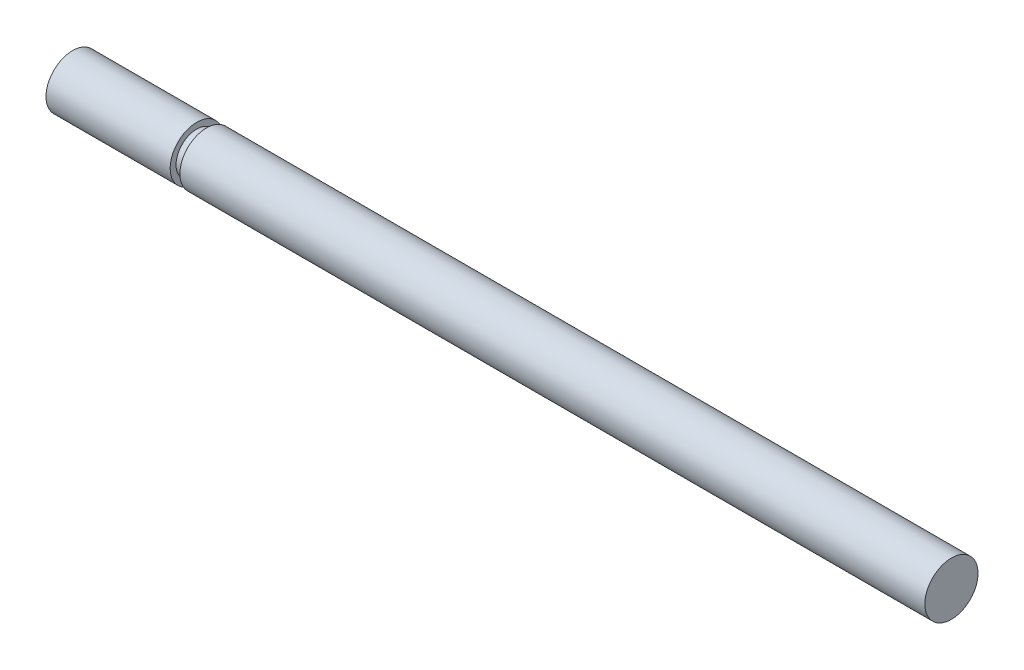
from build123d import *

# Parameters (mm, degrees)
CUT_EXTRUDE1_DEPTH      = 53.268065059
CUT_EXTRUDE1_DEPTH_BACK = 53.268065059


with BuildPart() as part:
    # Sketch1 → Revolve1 (revolve)
    with BuildSketch(Plane.XY, mode=Mode.PRIVATE) as revolve1_sk:
        Polygon((1.125, 0), (1.125, 1.5), (8.125, 1.5), (8.125, 1.166666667), (8.675, 1.166666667), (8.675, 1.5), (50.675, 1.5), (50.675, 1.166666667), (51.225, 1.166666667), (51.225, 1.5), (52.225, 1.5), (52.225, 0), align=None)
    revolve(revolve1_sk.sketch.rotate(Axis((0, 0, 0), (1, 0, 0)), 90), axis=Axis((0, 0, 0), (1, 0, 0)))

    # Sketch2 → Cut-Extrude1 (cut, two sides: drawn at the far end of the back side and taken through both)
    with BuildSketch(Plane.XY.offset(-CUT_EXTRUDE1_DEPTH_BACK)):
        Polygon((50.675, 110.781468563), (50.675, 1.5), (50.675, -1.5), (50.675, -110.781468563), (269.237937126, -110.781468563), (269.237937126, 110.781468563), align=None)
    extrude(amount=CUT_EXTRUDE1_DEPTH + CUT_EXTRUDE1_DEPTH_BACK, mode=Mode.SUBTRACT)


solid = part.part
